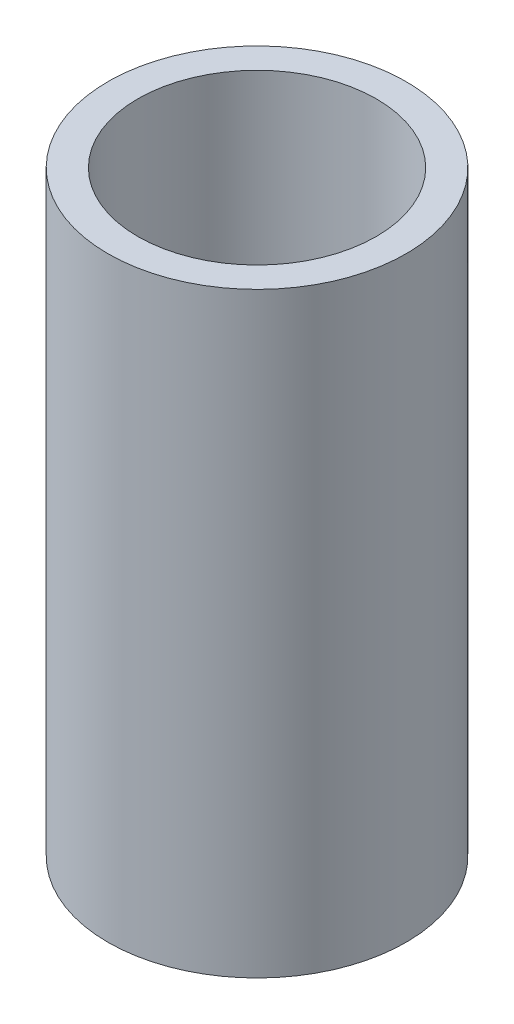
from build123d import *

# Parameters (mm, degrees)
SKETCH1_R      = 25
SKETCH1_R_2    = 20
EXTRUDE1_DEPTH = 100


with BuildPart() as part:
    # Sketch1 → Extrude1 (new body)
    with BuildSketch(Plane(origin=(0, 0, 0), x_dir=(1, 0, 0), z_dir=(0, 1, 0))):
        with Locations(Location((0, 0, 0), (0, 0, 270))):
            Circle(SKETCH1_R)
        with Locations(Location((0, 0, 0), (0, 0, 270))):
            Circle(SKETCH1_R_2, mode=Mode.SUBTRACT)
    extrude(amount=EXTRUDE1_DEPTH)


solid = part.part
